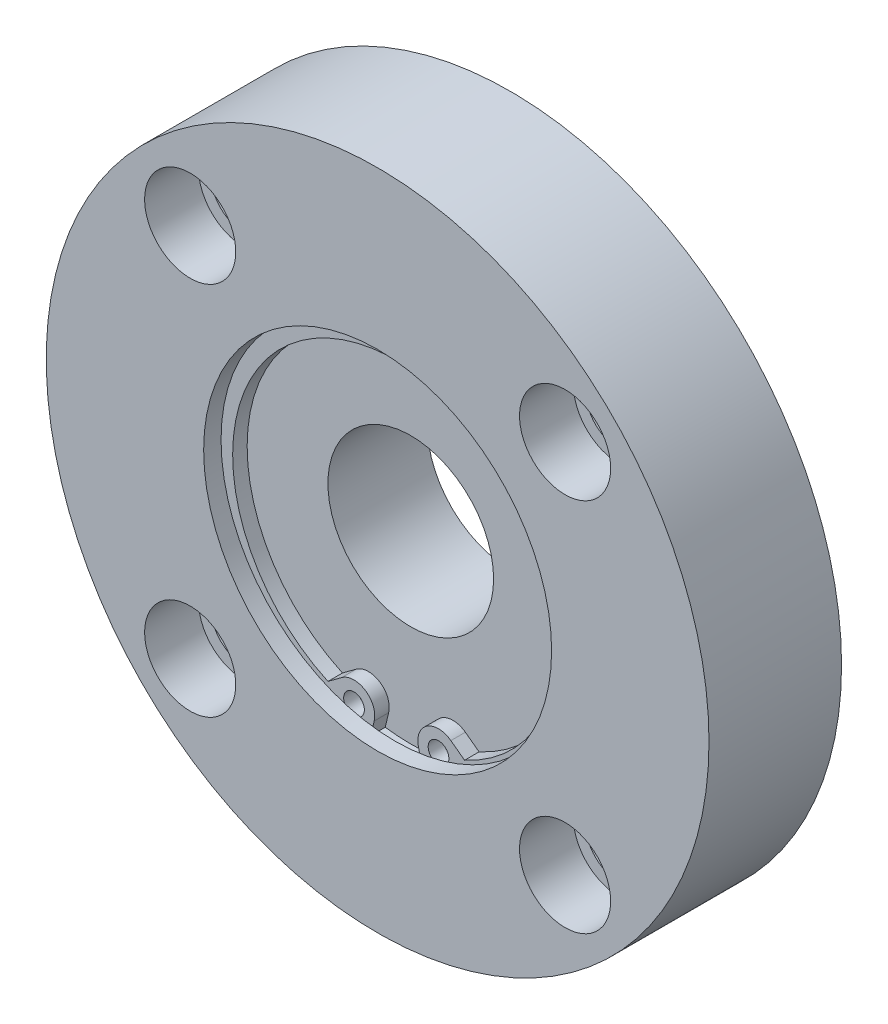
ISO-10303-21;
HEADER;
FILE_DESCRIPTION(('STEP AP214'),'2;1');
FILE_NAME('part.step','',(''),(''),'','','');
FILE_SCHEMA(('AUTOMOTIVE_DESIGN { 1 0 10303 214 1 1 1 1 }'));
ENDSEC;
DATA;
#1=APPLICATION_CONTEXT('core data for automotive mechanical design processes');
#2=APPLICATION_PROTOCOL_DEFINITION('international standard','automotive_design',2000,#1);
#3=PRODUCT_CONTEXT('',#1,'mechanical');
#4=PRODUCT('Part','Part','',(#3));
#5=PRODUCT_RELATED_PRODUCT_CATEGORY('part','',(#4));
#6=PRODUCT_DEFINITION_FORMATION('','',#4);
#7=PRODUCT_DEFINITION_CONTEXT('part definition',#1,'design');
#8=PRODUCT_DEFINITION('design','',#6,#7);
#9=PRODUCT_DEFINITION_SHAPE('','',#8);
#10=(LENGTH_UNIT() NAMED_UNIT(*) SI_UNIT(.MILLI.,.METRE.));
#11=(NAMED_UNIT(*) PLANE_ANGLE_UNIT() SI_UNIT($,.RADIAN.));
#12=(NAMED_UNIT(*) SI_UNIT($,.STERADIAN.) SOLID_ANGLE_UNIT());
#13=UNCERTAINTY_MEASURE_WITH_UNIT(LENGTH_MEASURE(1.E-05),#10,'distance_accuracy_value','');
#14=(GEOMETRIC_REPRESENTATION_CONTEXT(3) GLOBAL_UNCERTAINTY_ASSIGNED_CONTEXT((#13)) GLOBAL_UNIT_ASSIGNED_CONTEXT((#10,
#11,#12)) REPRESENTATION_CONTEXT('',''));
#15=CARTESIAN_POINT('',(0.,0.,0.));
#16=DIRECTION('',(0.,0.,1.));
#17=DIRECTION('',(1.,0.,0.));
#18=AXIS2_PLACEMENT_3D('',#15,#16,#17);
#19=CARTESIAN_POINT('',(2.6678231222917,-20.3027438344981,13.8));
#20=DIRECTION('',(0.972870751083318,0.231349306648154,0.));
#21=DIRECTION('',(0.,0.,-1.));
#22=AXIS2_PLACEMENT_3D('',#19,#20,#21);
#23=PLANE('',#22);
#24=DIRECTION('',(0.231349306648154,-0.972870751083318,0.));
#25=VECTOR('',#24,1.);
#26=CARTESIAN_POINT('',(2.6678231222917,-20.3027438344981,12.));
#27=LINE('',#26,#25);
#28=CARTESIAN_POINT('',(2.6678231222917,-20.3027438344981,12.));
#29=VERTEX_POINT('',#28);
#30=CARTESIAN_POINT('',(3.07994479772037,-22.0357990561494,12.));
#31=VERTEX_POINT('',#30);
#32=EDGE_CURVE('E28',#29,#31,#27,.T.);
#33=ORIENTED_EDGE('',*,*,#32,.T.);
#34=DIRECTION('',(0.,0.,-1.));
#35=VECTOR('',#34,1.);
#36=CARTESIAN_POINT('',(3.07994479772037,-22.0357990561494,13.9));
#37=LINE('',#36,#35);
#38=CARTESIAN_POINT('',(3.07994479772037,-22.0357990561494,13.75));
#39=VERTEX_POINT('',#38);
#40=EDGE_CURVE('E9',#31,#39,#37,.F.);
#41=ORIENTED_EDGE('',*,*,#40,.T.);
#42=DIRECTION('',(0.231349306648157,-0.972870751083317,0.));
#43=VECTOR('',#42,1.);
#44=CARTESIAN_POINT('',(2.6678231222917,-20.3027438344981,13.75));
#45=LINE('',#44,#43);
#46=CARTESIAN_POINT('',(2.66782312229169,-20.3027438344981,13.75));
#47=VERTEX_POINT('',#46);
#48=EDGE_CURVE('E248',#47,#39,#45,.T.);
#49=ORIENTED_EDGE('',*,*,#48,.F.);
#50=DIRECTION('',(0.,0.,-1.));
#51=VECTOR('',#50,1.);
#52=CARTESIAN_POINT('',(2.6678231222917,-20.3027438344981,13.8));
#53=LINE('',#52,#51);
#54=EDGE_CURVE('E144',#47,#29,#53,.T.);
#55=ORIENTED_EDGE('',*,*,#54,.T.);
#56=EDGE_LOOP('',(#33,#41,#49,#55));
#57=FACE_BOUND('',#56,.T.);
#58=ADVANCED_FACE('F14',(#57),#23,.F.);
#59=CARTESIAN_POINT('',(5.1,-19.7243705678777,13.8));
#60=DIRECTION('',(0.,0.,1.));
#61=DIRECTION('',(-1.,0.,0.));
#62=AXIS2_PLACEMENT_3D('',#59,#60,#61);
#63=CYLINDRICAL_SURFACE('',#62,2.5);
#64=ORIENTED_EDGE('',*,*,#54,.F.);
#65=CARTESIAN_POINT('',(5.1,-19.7243705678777,13.75));
#66=DIRECTION('',(0.,0.,1.));
#67=DIRECTION('',(1.,0.,0.));
#68=AXIS2_PLACEMENT_3D('',#65,#66,#67);
#69=CIRCLE('',#68,2.5);
#70=CARTESIAN_POINT('',(6.59138441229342,-17.7179377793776,13.75));
#71=VERTEX_POINT('',#70);
#72=EDGE_CURVE('E252',#71,#47,#69,.T.);
#73=ORIENTED_EDGE('',*,*,#72,.F.);
#74=DIRECTION('',(0.,0.,-1.));
#75=VECTOR('',#74,1.);
#76=CARTESIAN_POINT('',(6.59138441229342,-17.7179377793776,13.8));
#77=LINE('',#76,#75);
#78=CARTESIAN_POINT('',(6.59138441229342,-17.7179377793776,12.));
#79=VERTEX_POINT('',#78);
#80=EDGE_CURVE('E137',#71,#79,#77,.T.);
#81=ORIENTED_EDGE('',*,*,#80,.T.);
#82=CARTESIAN_POINT('',(5.1,-19.7243705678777,12.));
#83=DIRECTION('',(0.,0.,1.));
#84=DIRECTION('',(1.,0.,0.));
#85=AXIS2_PLACEMENT_3D('',#82,#83,#84);
#86=CIRCLE('',#85,2.5);
#87=EDGE_CURVE('E140',#79,#29,#86,.T.);
#88=ORIENTED_EDGE('',*,*,#87,.T.);
#89=EDGE_LOOP('',(#64,#73,#81,#88));
#90=FACE_BOUND('',#89,.T.);
#91=ADVANCED_FACE('F251',(#90),#63,.T.);
#92=CARTESIAN_POINT('',(6.59138441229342,-17.7179377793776,13.8));
#93=DIRECTION('',(-0.596553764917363,-0.802573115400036,0.));
#94=DIRECTION('',(-0.802573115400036,0.596553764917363,0.));
#95=AXIS2_PLACEMENT_3D('',#92,#93,#94);
#96=PLANE('',#95);
#97=DIRECTION('',(-0.802573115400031,0.59655376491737,0.));
#98=VECTOR('',#97,1.);
#99=CARTESIAN_POINT('',(8.24465388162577,-18.9468153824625,13.75));
#100=LINE('',#99,#98);
#101=CARTESIAN_POINT('',(8.24465388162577,-18.9468153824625,13.75));
#102=VERTEX_POINT('',#101);
#103=EDGE_CURVE('E723',#102,#71,#100,.T.);
#104=ORIENTED_EDGE('',*,*,#103,.F.);
#105=DIRECTION('',(0.,0.,-1.));
#106=VECTOR('',#105,1.);
#107=CARTESIAN_POINT('',(8.24465388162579,-18.9468153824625,13.8));
#108=LINE('',#107,#106);
#109=CARTESIAN_POINT('',(8.24465388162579,-18.9468153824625,12.));
#110=VERTEX_POINT('',#109);
#111=EDGE_CURVE('E255',#102,#110,#108,.T.);
#112=ORIENTED_EDGE('',*,*,#111,.T.);
#113=DIRECTION('',(-0.802573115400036,0.596553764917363,0.));
#114=VECTOR('',#113,1.);
#115=CARTESIAN_POINT('',(6.59138441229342,-17.7179377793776,12.));
#116=LINE('',#115,#114);
#117=EDGE_CURVE('E136',#110,#79,#116,.T.);
#118=ORIENTED_EDGE('',*,*,#117,.T.);
#119=ORIENTED_EDGE('',*,*,#80,.F.);
#120=EDGE_LOOP('',(#104,#112,#118,#119));
#121=FACE_BOUND('',#120,.T.);
#122=ADVANCED_FACE('F522',(#121),#96,.F.);
#123=CARTESIAN_POINT('',(0.,-1.,13.8));
#124=DIRECTION('',(0.,0.,1.));
#125=DIRECTION('',(-1.,0.,0.));
#126=AXIS2_PLACEMENT_3D('',#123,#124,#125);
#127=CYLINDRICAL_SURFACE('',#126,19.75);
#128=CARTESIAN_POINT('',(0.,-1.,13.75));
#129=DIRECTION('',(0.,0.,-1.));
#130=DIRECTION('',(1.,0.,0.));
#131=AXIS2_PLACEMENT_3D('',#128,#129,#130);
#132=CIRCLE('',#131,19.75);
#133=CARTESIAN_POINT('',(-8.24465388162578,-18.9468153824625,13.75));
#134=VERTEX_POINT('',#133);
#135=EDGE_CURVE('E106',#134,#102,#132,.T.);
#136=ORIENTED_EDGE('',*,*,#135,.F.);
#137=DIRECTION('',(0.,0.,-1.));
#138=VECTOR('',#137,1.);
#139=CARTESIAN_POINT('',(-8.24465388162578,-18.9468153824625,13.8));
#140=LINE('',#139,#138);
#141=CARTESIAN_POINT('',(-8.24465388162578,-18.9468153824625,12.));
#142=VERTEX_POINT('',#141);
#143=EDGE_CURVE('E105',#134,#142,#140,.T.);
#144=ORIENTED_EDGE('',*,*,#143,.T.);
#145=CARTESIAN_POINT('',(0.,-1.,12.));
#146=DIRECTION('',(0.,0.,-1.));
#147=DIRECTION('',(0.,-1.,0.));
#148=AXIS2_PLACEMENT_3D('',#145,#146,#147);
#149=CIRCLE('',#148,19.75);
#150=EDGE_CURVE('E124',#142,#110,#149,.T.);
#151=ORIENTED_EDGE('',*,*,#150,.T.);
#152=ORIENTED_EDGE('',*,*,#111,.F.);
#153=EDGE_LOOP('',(#136,#144,#151,#152));
#154=FACE_BOUND('',#153,.T.);
#155=ADVANCED_FACE('F551',(#154),#127,.F.);
#156=CARTESIAN_POINT('',(-6.59138441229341,-17.7179377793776,13.8));
#157=DIRECTION('',(0.596553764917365,-0.802573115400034,0.));
#158=DIRECTION('',(0.,0.,-1.));
#159=AXIS2_PLACEMENT_3D('',#156,#157,#158);
#160=PLANE('',#159);
#161=DIRECTION('',(-0.802573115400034,-0.596553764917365,0.));
#162=VECTOR('',#161,1.);
#163=CARTESIAN_POINT('',(-6.59138441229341,-17.7179377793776,13.75));
#164=LINE('',#163,#162);
#165=CARTESIAN_POINT('',(-6.59138441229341,-17.7179377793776,13.75));
#166=VERTEX_POINT('',#165);
#167=EDGE_CURVE('E89',#166,#134,#164,.T.);
#168=ORIENTED_EDGE('',*,*,#167,.F.);
#169=DIRECTION('',(0.,0.,-1.));
#170=VECTOR('',#169,1.);
#171=CARTESIAN_POINT('',(-6.59138441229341,-17.7179377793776,13.8));
#172=LINE('',#171,#170);
#173=CARTESIAN_POINT('',(-6.59138441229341,-17.7179377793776,12.));
#174=VERTEX_POINT('',#173);
#175=EDGE_CURVE('E103',#166,#174,#172,.T.);
#176=ORIENTED_EDGE('',*,*,#175,.T.);
#177=DIRECTION('',(-0.802573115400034,-0.596553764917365,0.));
#178=VECTOR('',#177,1.);
#179=CARTESIAN_POINT('',(-6.59138441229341,-17.7179377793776,12.));
#180=LINE('',#179,#178);
#181=EDGE_CURVE('E112',#174,#142,#180,.T.);
#182=ORIENTED_EDGE('',*,*,#181,.T.);
#183=ORIENTED_EDGE('',*,*,#143,.F.);
#184=EDGE_LOOP('',(#168,#176,#182,#183));
#185=FACE_BOUND('',#184,.T.);
#186=ADVANCED_FACE('F102',(#185),#160,.F.);
#187=CARTESIAN_POINT('',(-5.1,-19.7243705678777,13.8));
#188=DIRECTION('',(0.,0.,1.));
#189=DIRECTION('',(-1.,0.,0.));
#190=AXIS2_PLACEMENT_3D('',#187,#188,#189);
#191=CYLINDRICAL_SURFACE('',#190,2.5);
#192=ORIENTED_EDGE('',*,*,#175,.F.);
#193=CARTESIAN_POINT('',(-5.1,-19.7243705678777,13.75));
#194=DIRECTION('',(0.,0.,1.));
#195=DIRECTION('',(1.,0.,0.));
#196=AXIS2_PLACEMENT_3D('',#193,#194,#195);
#197=CIRCLE('',#196,2.5);
#198=CARTESIAN_POINT('',(-2.66782312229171,-20.3027438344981,13.75));
#199=VERTEX_POINT('',#198);
#200=EDGE_CURVE('E86',#199,#166,#197,.T.);
#201=ORIENTED_EDGE('',*,*,#200,.F.);
#202=DIRECTION('',(0.,0.,-1.));
#203=VECTOR('',#202,1.);
#204=CARTESIAN_POINT('',(-2.66782312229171,-20.3027438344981,13.8));
#205=LINE('',#204,#203);
#206=CARTESIAN_POINT('',(-2.66782312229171,-20.3027438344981,12.));
#207=VERTEX_POINT('',#206);
#208=EDGE_CURVE('E131',#199,#207,#205,.T.);
#209=ORIENTED_EDGE('',*,*,#208,.T.);
#210=CARTESIAN_POINT('',(-5.1,-19.7243705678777,12.));
#211=DIRECTION('',(0.,0.,1.));
#212=DIRECTION('',(-1.,0.,0.));
#213=AXIS2_PLACEMENT_3D('',#210,#211,#212);
#214=CIRCLE('',#213,2.5);
#215=EDGE_CURVE('E109',#207,#174,#214,.T.);
#216=ORIENTED_EDGE('',*,*,#215,.T.);
#217=EDGE_LOOP('',(#192,#201,#209,#216));
#218=FACE_BOUND('',#217,.T.);
#219=ADVANCED_FACE('F108',(#218),#191,.T.);
#220=CARTESIAN_POINT('',(-2.66782312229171,-20.3027438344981,13.8));
#221=DIRECTION('',(-0.97287075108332,0.231349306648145,0.));
#222=DIRECTION('',(0.,0.,1.));
#223=AXIS2_PLACEMENT_3D('',#220,#221,#222);
#224=PLANE('',#223);
#225=DIRECTION('',(0.23134930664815,0.972870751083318,0.));
#226=VECTOR('',#225,1.);
#227=CARTESIAN_POINT('',(-3.19612742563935,-22.5243705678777,13.75));
#228=LINE('',#227,#226);
#229=CARTESIAN_POINT('',(-3.07994479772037,-22.0357990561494,13.75));
#230=VERTEX_POINT('',#229);
#231=EDGE_CURVE('E92',#230,#199,#228,.T.);
#232=ORIENTED_EDGE('',*,*,#231,.F.);
#233=DIRECTION('',(0.,0.,-1.));
#234=VECTOR('',#233,1.);
#235=CARTESIAN_POINT('',(-3.07994479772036,-22.0357990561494,13.9));
#236=LINE('',#235,#234);
#237=CARTESIAN_POINT('',(-3.07994479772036,-22.0357990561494,12.));
#238=VERTEX_POINT('',#237);
#239=EDGE_CURVE('E22',#230,#238,#236,.T.);
#240=ORIENTED_EDGE('',*,*,#239,.T.);
#241=DIRECTION('',(0.231349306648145,0.97287075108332,0.));
#242=VECTOR('',#241,1.);
#243=CARTESIAN_POINT('',(-2.66782312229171,-20.3027438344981,12.));
#244=LINE('',#243,#242);
#245=EDGE_CURVE('E36',#238,#207,#244,.T.);
#246=ORIENTED_EDGE('',*,*,#245,.T.);
#247=ORIENTED_EDGE('',*,*,#208,.F.);
#248=EDGE_LOOP('',(#232,#240,#246,#247));
#249=FACE_BOUND('',#248,.T.);
#250=ADVANCED_FACE('F238',(#249),#224,.F.);
#251=CARTESIAN_POINT('',(5.1,-19.7243705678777,13.8));
#252=DIRECTION('',(0.,0.,1.));
#253=DIRECTION('',(-1.,0.,0.));
#254=AXIS2_PLACEMENT_3D('',#251,#252,#253);
#255=CYLINDRICAL_SURFACE('',#254,1.25);
#256=CARTESIAN_POINT('',(5.1,-19.7243705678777,12.));
#257=DIRECTION('',(0.,0.,1.));
#258=DIRECTION('',(1.,0.,0.));
#259=AXIS2_PLACEMENT_3D('',#256,#257,#258);
#260=CIRCLE('',#259,1.25);
#261=CARTESIAN_POINT('',(6.35,-19.7243705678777,12.));
#262=VERTEX_POINT('',#261);
#263=EDGE_CURVE('E113',#262,#262,#260,.T.);
#264=ORIENTED_EDGE('',*,*,#263,.F.);
#265=EDGE_LOOP('',(#264));
#266=FACE_BOUND('',#265,.T.);
#267=CARTESIAN_POINT('',(5.1,-19.7243705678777,13.75));
#268=DIRECTION('',(0.,0.,1.));
#269=DIRECTION('',(1.,0.,0.));
#270=AXIS2_PLACEMENT_3D('',#267,#268,#269);
#271=CIRCLE('',#270,1.25);
#272=CARTESIAN_POINT('',(6.35,-19.7243705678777,13.75));
#273=VERTEX_POINT('',#272);
#274=EDGE_CURVE('E149',#273,#273,#271,.F.);
#275=ORIENTED_EDGE('',*,*,#274,.F.);
#276=EDGE_LOOP('',(#275));
#277=FACE_BOUND('',#276,.T.);
#278=ADVANCED_FACE('F277',(#266,#277),#255,.F.);
#279=CARTESIAN_POINT('',(-5.1,-19.7243705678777,13.8));
#280=DIRECTION('',(0.,0.,1.));
#281=DIRECTION('',(-1.,0.,0.));
#282=AXIS2_PLACEMENT_3D('',#279,#280,#281);
#283=CYLINDRICAL_SURFACE('',#282,1.25);
#284=CARTESIAN_POINT('',(-5.1,-19.7243705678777,12.));
#285=DIRECTION('',(0.,0.,-1.));
#286=DIRECTION('',(1.,0.,0.));
#287=AXIS2_PLACEMENT_3D('',#284,#285,#286);
#288=CIRCLE('',#287,1.25);
#289=CARTESIAN_POINT('',(-3.85,-19.7243705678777,12.));
#290=VERTEX_POINT('',#289);
#291=EDGE_CURVE('E133',#290,#290,#288,.T.);
#292=ORIENTED_EDGE('',*,*,#291,.T.);
#293=EDGE_LOOP('',(#292));
#294=FACE_BOUND('',#293,.T.);
#295=CARTESIAN_POINT('',(-5.1,-19.7243705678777,13.75));
#296=DIRECTION('',(0.,0.,1.));
#297=DIRECTION('',(1.,0.,0.));
#298=AXIS2_PLACEMENT_3D('',#295,#296,#297);
#299=CIRCLE('',#298,1.25);
#300=CARTESIAN_POINT('',(-3.85,-19.7243705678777,13.75));
#301=VERTEX_POINT('',#300);
#302=EDGE_CURVE('E152',#301,#301,#299,.F.);
#303=ORIENTED_EDGE('',*,*,#302,.F.);
#304=EDGE_LOOP('',(#303));
#305=FACE_BOUND('',#304,.T.);
#306=ADVANCED_FACE('F275',(#294,#305),#283,.F.);
#307=CARTESIAN_POINT('',(-5.1,-19.7243705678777,13.75));
#308=DIRECTION('',(0.,0.,1.));
#309=DIRECTION('',(1.,0.,0.));
#310=AXIS2_PLACEMENT_3D('',#307,#308,#309);
#311=PLANE('',#310);
#312=ORIENTED_EDGE('',*,*,#302,.T.);
#313=EDGE_LOOP('',(#312));
#314=FACE_BOUND('',#313,.T.);
#315=ORIENTED_EDGE('',*,*,#274,.T.);
#316=EDGE_LOOP('',(#315));
#317=FACE_BOUND('',#316,.T.);
#318=CARTESIAN_POINT('',(0.,0.,13.75));
#319=DIRECTION('',(0.,0.,1.));
#320=DIRECTION('',(1.,0.,0.));
#321=AXIS2_PLACEMENT_3D('',#318,#319,#320);
#322=CIRCLE('',#321,22.25);
#323=EDGE_CURVE('E120',#230,#39,#322,.F.);
#324=ORIENTED_EDGE('',*,*,#323,.F.);
#325=ORIENTED_EDGE('',*,*,#231,.T.);
#326=ORIENTED_EDGE('',*,*,#200,.T.);
#327=ORIENTED_EDGE('',*,*,#167,.T.);
#328=ORIENTED_EDGE('',*,*,#135,.T.);
#329=ORIENTED_EDGE('',*,*,#103,.T.);
#330=ORIENTED_EDGE('',*,*,#72,.T.);
#331=ORIENTED_EDGE('',*,*,#48,.T.);
#332=EDGE_LOOP('',(#324,#325,#326,#327,#328,#329,#330,#331));
#333=FACE_BOUND('',#332,.T.);
#334=ADVANCED_FACE('F88',(#314,#317,#333),#311,.T.);
#335=CARTESIAN_POINT('',(22.6274169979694,22.6274169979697,0.));
#336=DIRECTION('',(0.,0.,1.));
#337=DIRECTION('',(1.,0.,0.));
#338=AXIS2_PLACEMENT_3D('',#335,#336,#337);
#339=CYLINDRICAL_SURFACE('',#338,4.);
#340=CARTESIAN_POINT('',(22.6274169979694,22.6274169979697,0.));
#341=DIRECTION('',(0.,0.,1.));
#342=DIRECTION('',(1.,0.,0.));
#343=AXIS2_PLACEMENT_3D('',#340,#341,#342);
#344=CIRCLE('',#343,4.);
#345=CARTESIAN_POINT('',(26.6274169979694,22.6274169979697,0.));
#346=VERTEX_POINT('',#345);
#347=EDGE_CURVE('E213',#346,#346,#344,.T.);
#348=ORIENTED_EDGE('',*,*,#347,.F.);
#349=EDGE_LOOP('',(#348));
#350=FACE_BOUND('',#349,.T.);
#351=CARTESIAN_POINT('',(22.6274169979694,22.6274169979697,9.5));
#352=DIRECTION('',(0.,0.,1.));
#353=DIRECTION('',(1.,0.,0.));
#354=AXIS2_PLACEMENT_3D('',#351,#352,#353);
#355=CIRCLE('',#354,4.);
#356=CARTESIAN_POINT('',(26.6274169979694,22.6274169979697,9.5));
#357=VERTEX_POINT('',#356);
#358=EDGE_CURVE('E212',#357,#357,#355,.F.);
#359=ORIENTED_EDGE('',*,*,#358,.F.);
#360=EDGE_LOOP('',(#359));
#361=FACE_BOUND('',#360,.T.);
#362=ADVANCED_FACE('F284',(#350,#361),#339,.F.);
#363=CARTESIAN_POINT('',(22.6274169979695,-22.6274169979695,0.));
#364=DIRECTION('',(0.,0.,1.));
#365=DIRECTION('',(1.,0.,0.));
#366=AXIS2_PLACEMENT_3D('',#363,#364,#365);
#367=CYLINDRICAL_SURFACE('',#366,4.);
#368=CARTESIAN_POINT('',(22.6274169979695,-22.6274169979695,0.));
#369=DIRECTION('',(0.,0.,1.));
#370=DIRECTION('',(0.,-1.,0.));
#371=AXIS2_PLACEMENT_3D('',#368,#369,#370);
#372=CIRCLE('',#371,4.);
#373=CARTESIAN_POINT('',(22.6274169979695,-26.6274169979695,0.));
#374=VERTEX_POINT('',#373);
#375=EDGE_CURVE('E203',#374,#374,#372,.T.);
#376=ORIENTED_EDGE('',*,*,#375,.F.);
#377=EDGE_LOOP('',(#376));
#378=FACE_BOUND('',#377,.T.);
#379=CARTESIAN_POINT('',(22.6274169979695,-22.6274169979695,9.5));
#380=DIRECTION('',(0.,0.,1.));
#381=DIRECTION('',(1.,0.,0.));
#382=AXIS2_PLACEMENT_3D('',#379,#380,#381);
#383=CIRCLE('',#382,4.);
#384=CARTESIAN_POINT('',(26.6274169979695,-22.6274169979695,9.5));
#385=VERTEX_POINT('',#384);
#386=EDGE_CURVE('E196',#385,#385,#383,.F.);
#387=ORIENTED_EDGE('',*,*,#386,.F.);
#388=EDGE_LOOP('',(#387));
#389=FACE_BOUND('',#388,.T.);
#390=ADVANCED_FACE('F292',(#378,#389),#367,.F.);
#391=CARTESIAN_POINT('',(-22.6274169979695,-22.6274169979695,0.));
#392=DIRECTION('',(0.,0.,1.));
#393=DIRECTION('',(1.,0.,0.));
#394=AXIS2_PLACEMENT_3D('',#391,#392,#393);
#395=CYLINDRICAL_SURFACE('',#394,4.);
#396=CARTESIAN_POINT('',(-22.6274169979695,-22.6274169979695,0.));
#397=DIRECTION('',(0.,0.,1.));
#398=DIRECTION('',(-1.,0.,0.));
#399=AXIS2_PLACEMENT_3D('',#396,#397,#398);
#400=CIRCLE('',#399,4.);
#401=CARTESIAN_POINT('',(-26.6274169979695,-22.6274169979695,0.));
#402=VERTEX_POINT('',#401);
#403=EDGE_CURVE('E200',#402,#402,#400,.T.);
#404=ORIENTED_EDGE('',*,*,#403,.F.);
#405=EDGE_LOOP('',(#404));
#406=FACE_BOUND('',#405,.T.);
#407=CARTESIAN_POINT('',(-22.6274169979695,-22.6274169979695,9.5));
#408=DIRECTION('',(0.,0.,1.));
#409=DIRECTION('',(1.,0.,0.));
#410=AXIS2_PLACEMENT_3D('',#407,#408,#409);
#411=CIRCLE('',#410,4.);
#412=CARTESIAN_POINT('',(-18.6274169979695,-22.6274169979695,9.5));
#413=VERTEX_POINT('',#412);
#414=EDGE_CURVE('E189',#413,#413,#411,.F.);
#415=ORIENTED_EDGE('',*,*,#414,.F.);
#416=EDGE_LOOP('',(#415));
#417=FACE_BOUND('',#416,.T.);
#418=ADVANCED_FACE('F298',(#406,#417),#395,.F.);
#419=CARTESIAN_POINT('',(-22.6274169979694,22.6274169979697,0.));
#420=DIRECTION('',(0.,0.,1.));
#421=DIRECTION('',(1.,0.,0.));
#422=AXIS2_PLACEMENT_3D('',#419,#420,#421);
#423=CYLINDRICAL_SURFACE('',#422,4.);
#424=CARTESIAN_POINT('',(-22.6274169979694,22.6274169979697,0.));
#425=DIRECTION('',(0.,0.,1.));
#426=DIRECTION('',(0.,1.,0.));
#427=AXIS2_PLACEMENT_3D('',#424,#425,#426);
#428=CIRCLE('',#427,4.);
#429=CARTESIAN_POINT('',(-22.6274169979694,26.6274169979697,0.));
#430=VERTEX_POINT('',#429);
#431=EDGE_CURVE('E197',#430,#430,#428,.T.);
#432=ORIENTED_EDGE('',*,*,#431,.F.);
#433=EDGE_LOOP('',(#432));
#434=FACE_BOUND('',#433,.T.);
#435=CARTESIAN_POINT('',(-22.6274169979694,22.6274169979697,9.5));
#436=DIRECTION('',(0.,0.,1.));
#437=DIRECTION('',(1.,0.,0.));
#438=AXIS2_PLACEMENT_3D('',#435,#436,#437);
#439=CIRCLE('',#438,4.);
#440=CARTESIAN_POINT('',(-18.6274169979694,22.6274169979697,9.5));
#441=VERTEX_POINT('',#440);
#442=EDGE_CURVE('E182',#441,#441,#439,.F.);
#443=ORIENTED_EDGE('',*,*,#442,.F.);
#444=EDGE_LOOP('',(#443));
#445=FACE_BOUND('',#444,.T.);
#446=ADVANCED_FACE('F351',(#434,#445),#423,.F.);
#447=CARTESIAN_POINT('',(0.,0.,-5.));
#448=DIRECTION('',(0.,0.,1.));
#449=DIRECTION('',(1.,0.,0.));
#450=AXIS2_PLACEMENT_3D('',#447,#448,#449);
#451=CYLINDRICAL_SURFACE('',#450,25.);
#452=CARTESIAN_POINT('',(0.,0.,-5.));
#453=DIRECTION('',(0.,0.,-1.));
#454=DIRECTION('',(-1.,0.,0.));
#455=AXIS2_PLACEMENT_3D('',#452,#453,#454);
#456=CIRCLE('',#455,25.);
#457=CARTESIAN_POINT('',(-25.,0.,-5.));
#458=VERTEX_POINT('',#457);
#459=EDGE_CURVE('E166',#458,#458,#456,.T.);
#460=ORIENTED_EDGE('',*,*,#459,.F.);
#461=EDGE_LOOP('',(#460));
#462=FACE_BOUND('',#461,.T.);
#463=CARTESIAN_POINT('',(0.,0.,0.));
#464=DIRECTION('',(0.,0.,-1.));
#465=DIRECTION('',(-1.,0.,0.));
#466=AXIS2_PLACEMENT_3D('',#463,#464,#465);
#467=CIRCLE('',#466,25.);
#468=CARTESIAN_POINT('',(-25.,0.,0.));
#469=VERTEX_POINT('',#468);
#470=EDGE_CURVE('E97',#469,#469,#467,.T.);
#471=ORIENTED_EDGE('',*,*,#470,.T.);
#472=EDGE_LOOP('',(#471));
#473=FACE_BOUND('',#472,.T.);
#474=ADVANCED_FACE('F346',(#462,#473),#451,.T.);
#475=CARTESIAN_POINT('',(0.,0.,0.));
#476=DIRECTION('',(0.,0.,1.));
#477=DIRECTION('',(1.,0.,0.));
#478=AXIS2_PLACEMENT_3D('',#475,#476,#477);
#479=PLANE('',#478);
#480=ORIENTED_EDGE('',*,*,#431,.T.);
#481=EDGE_LOOP('',(#480));
#482=FACE_BOUND('',#481,.T.);
#483=ORIENTED_EDGE('',*,*,#403,.T.);
#484=EDGE_LOOP('',(#483));
#485=FACE_BOUND('',#484,.T.);
#486=ORIENTED_EDGE('',*,*,#375,.T.);
#487=EDGE_LOOP('',(#486));
#488=FACE_BOUND('',#487,.T.);
#489=ORIENTED_EDGE('',*,*,#347,.T.);
#490=EDGE_LOOP('',(#489));
#491=FACE_BOUND('',#490,.T.);
#492=CARTESIAN_POINT('',(0.,0.,0.));
#493=DIRECTION('',(0.,0.,1.));
#494=DIRECTION('',(1.,0.,0.));
#495=AXIS2_PLACEMENT_3D('',#492,#493,#494);
#496=CIRCLE('',#495,40.);
#497=CARTESIAN_POINT('',(40.,0.,0.));
#498=VERTEX_POINT('',#497);
#499=EDGE_CURVE('E219',#498,#498,#496,.T.);
#500=ORIENTED_EDGE('',*,*,#499,.F.);
#501=EDGE_LOOP('',(#500));
#502=FACE_BOUND('',#501,.T.);
#503=ORIENTED_EDGE('',*,*,#470,.F.);
#504=EDGE_LOOP('',(#503));
#505=FACE_BOUND('',#504,.T.);
#506=ADVANCED_FACE('F316',(#482,#485,#488,#491,#502,#505),#479,.F.);
#507=CARTESIAN_POINT('',(22.6274169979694,22.6274169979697,9.5));
#508=DIRECTION('',(0.,0.,1.));
#509=DIRECTION('',(1.,0.,0.));
#510=AXIS2_PLACEMENT_3D('',#507,#508,#509);
#511=PLANE('',#510);
#512=CARTESIAN_POINT('',(22.6274169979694,22.6274169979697,9.5));
#513=DIRECTION('',(0.,0.,1.));
#514=DIRECTION('',(1.,0.,0.));
#515=AXIS2_PLACEMENT_3D('',#512,#513,#514);
#516=CIRCLE('',#515,5.5);
#517=CARTESIAN_POINT('',(28.1274169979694,22.6274169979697,9.5));
#518=VERTEX_POINT('',#517);
#519=EDGE_CURVE('E209',#518,#518,#516,.T.);
#520=ORIENTED_EDGE('',*,*,#519,.T.);
#521=EDGE_LOOP('',(#520));
#522=FACE_BOUND('',#521,.T.);
#523=ORIENTED_EDGE('',*,*,#358,.T.);
#524=EDGE_LOOP('',(#523));
#525=FACE_BOUND('',#524,.T.);
#526=ADVANCED_FACE('F345',(#522,#525),#511,.T.);
#527=CARTESIAN_POINT('',(22.6274169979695,-22.6274169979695,9.5));
#528=DIRECTION('',(0.,0.,1.));
#529=DIRECTION('',(0.,-1.,0.));
#530=AXIS2_PLACEMENT_3D('',#527,#528,#529);
#531=PLANE('',#530);
#532=CARTESIAN_POINT('',(22.6274169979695,-22.6274169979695,9.5));
#533=DIRECTION('',(0.,0.,1.));
#534=DIRECTION('',(0.,-1.,0.));
#535=AXIS2_PLACEMENT_3D('',#532,#533,#534);
#536=CIRCLE('',#535,5.5);
#537=CARTESIAN_POINT('',(22.6274169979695,-28.1274169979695,9.5));
#538=VERTEX_POINT('',#537);
#539=EDGE_CURVE('E193',#538,#538,#536,.T.);
#540=ORIENTED_EDGE('',*,*,#539,.T.);
#541=EDGE_LOOP('',(#540));
#542=FACE_BOUND('',#541,.T.);
#543=ORIENTED_EDGE('',*,*,#386,.T.);
#544=EDGE_LOOP('',(#543));
#545=FACE_BOUND('',#544,.T.);
#546=ADVANCED_FACE('F381',(#542,#545),#531,.T.);
#547=CARTESIAN_POINT('',(-22.6274169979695,-22.6274169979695,9.5));
#548=DIRECTION('',(0.,0.,1.));
#549=DIRECTION('',(-1.,0.,0.));
#550=AXIS2_PLACEMENT_3D('',#547,#548,#549);
#551=PLANE('',#550);
#552=CARTESIAN_POINT('',(-22.6274169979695,-22.6274169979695,9.5));
#553=DIRECTION('',(0.,0.,1.));
#554=DIRECTION('',(-1.,0.,0.));
#555=AXIS2_PLACEMENT_3D('',#552,#553,#554);
#556=CIRCLE('',#555,5.5);
#557=CARTESIAN_POINT('',(-28.1274169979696,-22.6274169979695,9.5));
#558=VERTEX_POINT('',#557);
#559=EDGE_CURVE('E186',#558,#558,#556,.T.);
#560=ORIENTED_EDGE('',*,*,#559,.T.);
#561=EDGE_LOOP('',(#560));
#562=FACE_BOUND('',#561,.T.);
#563=ORIENTED_EDGE('',*,*,#414,.T.);
#564=EDGE_LOOP('',(#563));
#565=FACE_BOUND('',#564,.T.);
#566=ADVANCED_FACE('F373',(#562,#565),#551,.T.);
#567=CARTESIAN_POINT('',(-22.6274169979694,22.6274169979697,9.5));
#568=DIRECTION('',(0.,0.,1.));
#569=DIRECTION('',(0.,1.,0.));
#570=AXIS2_PLACEMENT_3D('',#567,#568,#569);
#571=PLANE('',#570);
#572=CARTESIAN_POINT('',(-22.6274169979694,22.6274169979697,9.5));
#573=DIRECTION('',(0.,0.,1.));
#574=DIRECTION('',(0.,1.,0.));
#575=AXIS2_PLACEMENT_3D('',#572,#573,#574);
#576=CIRCLE('',#575,5.5);
#577=CARTESIAN_POINT('',(-22.6274169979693,28.1274169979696,9.5));
#578=VERTEX_POINT('',#577);
#579=EDGE_CURVE('E179',#578,#578,#576,.T.);
#580=ORIENTED_EDGE('',*,*,#579,.T.);
#581=EDGE_LOOP('',(#580));
#582=FACE_BOUND('',#581,.T.);
#583=ORIENTED_EDGE('',*,*,#442,.T.);
#584=EDGE_LOOP('',(#583));
#585=FACE_BOUND('',#584,.T.);
#586=ADVANCED_FACE('F370',(#582,#585),#571,.T.);
#587=CARTESIAN_POINT('',(0.,0.,-5.));
#588=DIRECTION('',(0.,0.,-1.));
#589=DIRECTION('',(-1.,0.,0.));
#590=AXIS2_PLACEMENT_3D('',#587,#588,#589);
#591=PLANE('',#590);
#592=ORIENTED_EDGE('',*,*,#459,.T.);
#593=EDGE_LOOP('',(#592));
#594=FACE_BOUND('',#593,.T.);
#595=CARTESIAN_POINT('',(0.,0.,-5.));
#596=DIRECTION('',(0.,0.,-1.));
#597=DIRECTION('',(-1.,0.,0.));
#598=AXIS2_PLACEMENT_3D('',#595,#596,#597);
#599=CIRCLE('',#598,18.);
#600=CARTESIAN_POINT('',(-18.,0.,-5.));
#601=VERTEX_POINT('',#600);
#602=EDGE_CURVE('E163',#601,#601,#599,.T.);
#603=ORIENTED_EDGE('',*,*,#602,.F.);
#604=EDGE_LOOP('',(#603));
#605=FACE_BOUND('',#604,.T.);
#606=ADVANCED_FACE('F340',(#594,#605),#591,.T.);
#607=CARTESIAN_POINT('',(0.,0.,16.));
#608=DIRECTION('',(0.,0.,-1.));
#609=DIRECTION('',(-1.,0.,0.));
#610=AXIS2_PLACEMENT_3D('',#607,#608,#609);
#611=CYLINDRICAL_SURFACE('',#610,40.);
#612=CARTESIAN_POINT('',(0.,0.,16.));
#613=DIRECTION('',(0.,0.,1.));
#614=DIRECTION('',(1.,0.,0.));
#615=AXIS2_PLACEMENT_3D('',#612,#613,#614);
#616=CIRCLE('',#615,40.);
#617=CARTESIAN_POINT('',(40.,0.,16.));
#618=VERTEX_POINT('',#617);
#619=EDGE_CURVE('E169',#618,#618,#616,.T.);
#620=ORIENTED_EDGE('',*,*,#619,.F.);
#621=EDGE_LOOP('',(#620));
#622=FACE_BOUND('',#621,.T.);
#623=ORIENTED_EDGE('',*,*,#499,.T.);
#624=EDGE_LOOP('',(#623));
#625=FACE_BOUND('',#624,.T.);
#626=ADVANCED_FACE('F16',(#622,#625),#611,.T.);
#627=CARTESIAN_POINT('',(22.6274169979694,22.6274169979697,9.5));
#628=DIRECTION('',(0.,0.,1.));
#629=DIRECTION('',(1.,0.,0.));
#630=AXIS2_PLACEMENT_3D('',#627,#628,#629);
#631=CYLINDRICAL_SURFACE('',#630,5.5);
#632=ORIENTED_EDGE('',*,*,#519,.F.);
#633=EDGE_LOOP('',(#632));
#634=FACE_BOUND('',#633,.T.);
#635=CARTESIAN_POINT('',(22.6274169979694,22.6274169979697,16.));
#636=DIRECTION('',(0.,0.,1.));
#637=DIRECTION('',(1.,0.,0.));
#638=AXIS2_PLACEMENT_3D('',#635,#636,#637);
#639=CIRCLE('',#638,5.5);
#640=CARTESIAN_POINT('',(28.1274169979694,22.6274169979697,16.));
#641=VERTEX_POINT('',#640);
#642=EDGE_CURVE('E206',#641,#641,#639,.T.);
#643=ORIENTED_EDGE('',*,*,#642,.T.);
#644=EDGE_LOOP('',(#643));
#645=FACE_BOUND('',#644,.T.);
#646=ADVANCED_FACE('F305',(#634,#645),#631,.F.);
#647=CARTESIAN_POINT('',(22.6274169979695,-22.6274169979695,9.5));
#648=DIRECTION('',(0.,0.,1.));
#649=DIRECTION('',(1.,0.,0.));
#650=AXIS2_PLACEMENT_3D('',#647,#648,#649);
#651=CYLINDRICAL_SURFACE('',#650,5.5);
#652=ORIENTED_EDGE('',*,*,#539,.F.);
#653=EDGE_LOOP('',(#652));
#654=FACE_BOUND('',#653,.T.);
#655=CARTESIAN_POINT('',(22.6274169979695,-22.6274169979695,16.));
#656=DIRECTION('',(0.,0.,1.));
#657=DIRECTION('',(0.,-1.,0.));
#658=AXIS2_PLACEMENT_3D('',#655,#656,#657);
#659=CIRCLE('',#658,5.5);
#660=CARTESIAN_POINT('',(22.6274169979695,-28.1274169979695,16.));
#661=VERTEX_POINT('',#660);
#662=EDGE_CURVE('E190',#661,#661,#659,.T.);
#663=ORIENTED_EDGE('',*,*,#662,.T.);
#664=EDGE_LOOP('',(#663));
#665=FACE_BOUND('',#664,.T.);
#666=ADVANCED_FACE('F385',(#654,#665),#651,.F.);
#667=CARTESIAN_POINT('',(-22.6274169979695,-22.6274169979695,9.5));
#668=DIRECTION('',(0.,0.,1.));
#669=DIRECTION('',(1.,0.,0.));
#670=AXIS2_PLACEMENT_3D('',#667,#668,#669);
#671=CYLINDRICAL_SURFACE('',#670,5.5);
#672=ORIENTED_EDGE('',*,*,#559,.F.);
#673=EDGE_LOOP('',(#672));
#674=FACE_BOUND('',#673,.T.);
#675=CARTESIAN_POINT('',(-22.6274169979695,-22.6274169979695,16.));
#676=DIRECTION('',(0.,0.,1.));
#677=DIRECTION('',(-1.,0.,0.));
#678=AXIS2_PLACEMENT_3D('',#675,#676,#677);
#679=CIRCLE('',#678,5.5);
#680=CARTESIAN_POINT('',(-28.1274169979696,-22.6274169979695,16.));
#681=VERTEX_POINT('',#680);
#682=EDGE_CURVE('E183',#681,#681,#679,.T.);
#683=ORIENTED_EDGE('',*,*,#682,.T.);
#684=EDGE_LOOP('',(#683));
#685=FACE_BOUND('',#684,.T.);
#686=ADVANCED_FACE('F377',(#674,#685),#671,.F.);
#687=CARTESIAN_POINT('',(-22.6274169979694,22.6274169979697,9.5));
#688=DIRECTION('',(0.,0.,1.));
#689=DIRECTION('',(1.,0.,0.));
#690=AXIS2_PLACEMENT_3D('',#687,#688,#689);
#691=CYLINDRICAL_SURFACE('',#690,5.5);
#692=ORIENTED_EDGE('',*,*,#579,.F.);
#693=EDGE_LOOP('',(#692));
#694=FACE_BOUND('',#693,.T.);
#695=CARTESIAN_POINT('',(-22.6274169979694,22.6274169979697,16.));
#696=DIRECTION('',(0.,0.,1.));
#697=DIRECTION('',(0.,1.,0.));
#698=AXIS2_PLACEMENT_3D('',#695,#696,#697);
#699=CIRCLE('',#698,5.5);
#700=CARTESIAN_POINT('',(-22.6274169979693,28.1274169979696,16.));
#701=VERTEX_POINT('',#700);
#702=EDGE_CURVE('E176',#701,#701,#699,.T.);
#703=ORIENTED_EDGE('',*,*,#702,.T.);
#704=EDGE_LOOP('',(#703));
#705=FACE_BOUND('',#704,.T.);
#706=ADVANCED_FACE('F323',(#694,#705),#691,.F.);
#707=CARTESIAN_POINT('',(0.,0.,-5.));
#708=DIRECTION('',(0.,0.,1.));
#709=DIRECTION('',(1.,0.,0.));
#710=AXIS2_PLACEMENT_3D('',#707,#708,#709);
#711=CYLINDRICAL_SURFACE('',#710,18.);
#712=ORIENTED_EDGE('',*,*,#602,.T.);
#713=EDGE_LOOP('',(#712));
#714=FACE_BOUND('',#713,.T.);
#715=CARTESIAN_POINT('',(0.,0.,0.));
#716=DIRECTION('',(0.,0.,-1.));
#717=DIRECTION('',(-1.,0.,0.));
#718=AXIS2_PLACEMENT_3D('',#715,#716,#717);
#719=CIRCLE('',#718,18.);
#720=CARTESIAN_POINT('',(-18.,0.,0.));
#721=VERTEX_POINT('',#720);
#722=EDGE_CURVE('E160',#721,#721,#719,.T.);
#723=ORIENTED_EDGE('',*,*,#722,.F.);
#724=EDGE_LOOP('',(#723));
#725=FACE_BOUND('',#724,.T.);
#726=ADVANCED_FACE('F318',(#714,#725),#711,.F.);
#727=CARTESIAN_POINT('',(0.,0.,16.));
#728=DIRECTION('',(0.,0.,1.));
#729=DIRECTION('',(1.,0.,0.));
#730=AXIS2_PLACEMENT_3D('',#727,#728,#729);
#731=PLANE('',#730);
#732=CARTESIAN_POINT('',(0.,0.,16.));
#733=DIRECTION('',(0.,0.,1.));
#734=DIRECTION('',(1.,0.,0.));
#735=AXIS2_PLACEMENT_3D('',#732,#733,#734);
#736=CIRCLE('',#735,21.);
#737=CARTESIAN_POINT('',(21.,0.,16.));
#738=VERTEX_POINT('',#737);
#739=EDGE_CURVE('E172',#738,#738,#736,.T.);
#740=ORIENTED_EDGE('',*,*,#739,.F.);
#741=EDGE_LOOP('',(#740));
#742=FACE_BOUND('',#741,.T.);
#743=ORIENTED_EDGE('',*,*,#702,.F.);
#744=EDGE_LOOP('',(#743));
#745=FACE_BOUND('',#744,.T.);
#746=ORIENTED_EDGE('',*,*,#682,.F.);
#747=EDGE_LOOP('',(#746));
#748=FACE_BOUND('',#747,.T.);
#749=ORIENTED_EDGE('',*,*,#662,.F.);
#750=EDGE_LOOP('',(#749));
#751=FACE_BOUND('',#750,.T.);
#752=ORIENTED_EDGE('',*,*,#642,.F.);
#753=EDGE_LOOP('',(#752));
#754=FACE_BOUND('',#753,.T.);
#755=ORIENTED_EDGE('',*,*,#619,.T.);
#756=EDGE_LOOP('',(#755));
#757=FACE_BOUND('',#756,.T.);
#758=ADVANCED_FACE('F314',(#742,#745,#748,#751,#754,#757),#731,.T.);
#759=ORIENTED_EDGE('',*,*,#722,.T.);
#760=EDGE_LOOP('',(#759));
#761=FACE_BOUND('',#760,.T.);
#762=CARTESIAN_POINT('',(0.,0.,0.));
#763=DIRECTION('',(0.,0.,1.));
#764=DIRECTION('',(1.,0.,0.));
#765=AXIS2_PLACEMENT_3D('',#762,#763,#764);
#766=CIRCLE('',#765,10.);
#767=CARTESIAN_POINT('',(10.,0.,0.));
#768=VERTEX_POINT('',#767);
#769=EDGE_CURVE('E216',#768,#768,#766,.T.);
#770=ORIENTED_EDGE('',*,*,#769,.T.);
#771=EDGE_LOOP('',(#770));
#772=FACE_BOUND('',#771,.T.);
#773=ADVANCED_FACE('F312',(#761,#772),#479,.F.);
#774=CARTESIAN_POINT('',(0.,0.,12.));
#775=DIRECTION('',(0.,0.,1.));
#776=DIRECTION('',(1.,0.,0.));
#777=AXIS2_PLACEMENT_3D('',#774,#775,#776);
#778=CYLINDRICAL_SURFACE('',#777,21.);
#779=CARTESIAN_POINT('',(0.,0.,13.9));
#780=DIRECTION('',(0.,0.,1.));
#781=DIRECTION('',(1.,0.,0.));
#782=AXIS2_PLACEMENT_3D('',#779,#780,#781);
#783=CIRCLE('',#782,21.);
#784=CARTESIAN_POINT('',(21.,0.,13.9));
#785=VERTEX_POINT('',#784);
#786=EDGE_CURVE('E157',#785,#785,#783,.F.);
#787=ORIENTED_EDGE('',*,*,#786,.T.);
#788=EDGE_LOOP('',(#787));
#789=FACE_BOUND('',#788,.T.);
#790=ORIENTED_EDGE('',*,*,#739,.T.);
#791=EDGE_LOOP('',(#790));
#792=FACE_BOUND('',#791,.T.);
#793=ADVANCED_FACE('F310',(#789,#792),#778,.F.);
#794=CARTESIAN_POINT('',(0.,0.,16.));
#795=DIRECTION('',(0.,0.,-1.));
#796=DIRECTION('',(-1.,0.,0.));
#797=AXIS2_PLACEMENT_3D('',#794,#795,#796);
#798=CYLINDRICAL_SURFACE('',#797,10.);
#799=ORIENTED_EDGE('',*,*,#769,.F.);
#800=EDGE_LOOP('',(#799));
#801=FACE_BOUND('',#800,.T.);
#802=CARTESIAN_POINT('',(0.,0.,12.));
#803=DIRECTION('',(0.,0.,1.));
#804=DIRECTION('',(1.,0.,0.));
#805=AXIS2_PLACEMENT_3D('',#802,#803,#804);
#806=CIRCLE('',#805,10.);
#807=CARTESIAN_POINT('',(10.,0.,12.));
#808=VERTEX_POINT('',#807);
#809=EDGE_CURVE('E175',#808,#808,#806,.T.);
#810=ORIENTED_EDGE('',*,*,#809,.T.);
#811=EDGE_LOOP('',(#810));
#812=FACE_BOUND('',#811,.T.);
#813=ADVANCED_FACE('F307',(#801,#812),#798,.F.);
#814=CARTESIAN_POINT('',(0.,0.,12.));
#815=DIRECTION('',(0.,0.,1.));
#816=DIRECTION('',(1.,0.,0.));
#817=AXIS2_PLACEMENT_3D('',#814,#815,#816);
#818=PLANE('',#817);
#819=ORIENTED_EDGE('',*,*,#809,.F.);
#820=EDGE_LOOP('',(#819));
#821=FACE_BOUND('',#820,.T.);
#822=ORIENTED_EDGE('',*,*,#32,.F.);
#823=ORIENTED_EDGE('',*,*,#87,.F.);
#824=ORIENTED_EDGE('',*,*,#117,.F.);
#825=ORIENTED_EDGE('',*,*,#150,.F.);
#826=ORIENTED_EDGE('',*,*,#181,.F.);
#827=ORIENTED_EDGE('',*,*,#215,.F.);
#828=ORIENTED_EDGE('',*,*,#245,.F.);
#829=CARTESIAN_POINT('',(0.,0.,12.));
#830=DIRECTION('',(0.,0.,1.));
#831=DIRECTION('',(1.,0.,0.));
#832=AXIS2_PLACEMENT_3D('',#829,#830,#831);
#833=CIRCLE('',#832,22.25);
#834=EDGE_CURVE('E158',#238,#31,#833,.T.);
#835=ORIENTED_EDGE('',*,*,#834,.T.);
#836=EDGE_LOOP('',(#822,#823,#824,#825,#826,#827,#828,#835));
#837=FACE_BOUND('',#836,.T.);
#838=ADVANCED_FACE('F241',(#821,#837),#818,.T.);
#839=CARTESIAN_POINT('',(0.,0.,13.9));
#840=DIRECTION('',(0.,0.,1.));
#841=DIRECTION('',(1.,0.,0.));
#842=AXIS2_PLACEMENT_3D('',#839,#840,#841);
#843=PLANE('',#842);
#844=CARTESIAN_POINT('',(0.,0.,13.9));
#845=DIRECTION('',(0.,0.,1.));
#846=DIRECTION('',(1.,0.,0.));
#847=AXIS2_PLACEMENT_3D('',#844,#845,#846);
#848=CIRCLE('',#847,22.25);
#849=CARTESIAN_POINT('',(22.25,0.,13.9));
#850=VERTEX_POINT('',#849);
#851=EDGE_CURVE('E154',#850,#850,#848,.T.);
#852=ORIENTED_EDGE('',*,*,#851,.F.);
#853=EDGE_LOOP('',(#852));
#854=FACE_BOUND('',#853,.T.);
#855=ORIENTED_EDGE('',*,*,#786,.F.);
#856=EDGE_LOOP('',(#855));
#857=FACE_BOUND('',#856,.T.);
#858=ADVANCED_FACE('F364',(#854,#857),#843,.F.);
#859=CARTESIAN_POINT('',(0.,0.,13.9));
#860=DIRECTION('',(0.,0.,-1.));
#861=DIRECTION('',(-1.,0.,0.));
#862=AXIS2_PLACEMENT_3D('',#859,#860,#861);
#863=CYLINDRICAL_SURFACE('',#862,22.25);
#864=ORIENTED_EDGE('',*,*,#851,.T.);
#865=EDGE_LOOP('',(#864));
#866=FACE_BOUND('',#865,.T.);
#867=ORIENTED_EDGE('',*,*,#40,.F.);
#868=ORIENTED_EDGE('',*,*,#834,.F.);
#869=ORIENTED_EDGE('',*,*,#239,.F.);
#870=ORIENTED_EDGE('',*,*,#323,.T.);
#871=EDGE_LOOP('',(#867,#868,#869,#870));
#872=FACE_BOUND('',#871,.T.);
#873=ADVANCED_FACE('F240',(#866,#872),#863,.F.);
#874=ORIENTED_EDGE('',*,*,#263,.T.);
#875=EDGE_LOOP('',(#874));
#876=FACE_BOUND('',#875,.T.);
#877=ADVANCED_FACE('F286',(#876),#818,.T.);
#878=ORIENTED_EDGE('',*,*,#291,.F.);
#879=EDGE_LOOP('',(#878));
#880=FACE_BOUND('',#879,.T.);
#881=ADVANCED_FACE('F366',(#880),#818,.T.);
#882=CLOSED_SHELL('',(#58,#91,#122,#155,#186,#219,#250,#278,#306,#334,#362,#390,#418,#446,#474,
#506,#526,#546,#566,#586,#606,#626,#646,#666,#686,#706,#726,#758,#773,#793,#813,#838,#858,#873,
#877,#881));
#883=MANIFOLD_SOLID_BREP('B1',#882);
#884=ADVANCED_BREP_SHAPE_REPRESENTATION('',(#18,#883),#14);
#885=SHAPE_DEFINITION_REPRESENTATION(#9,#884);
ENDSEC;
END-ISO-10303-21;
